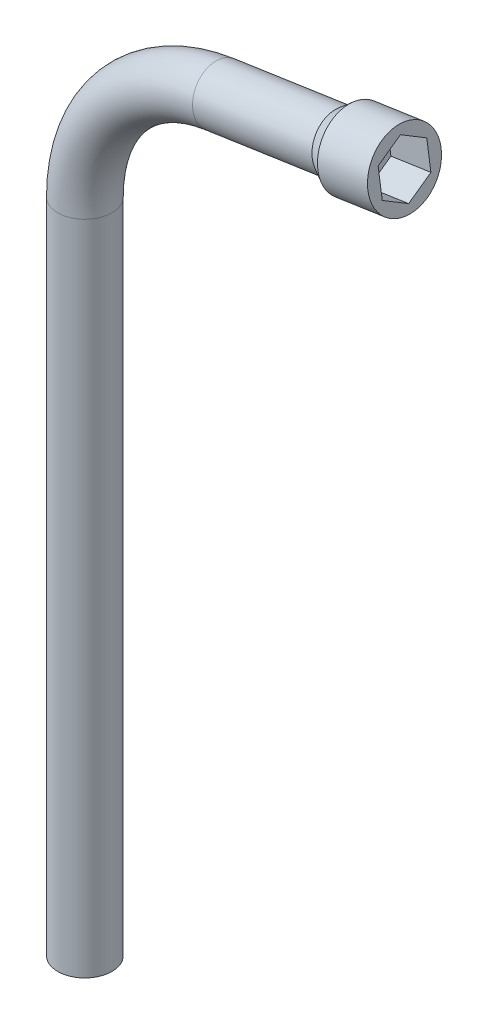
ISO-10303-21;
HEADER;
FILE_DESCRIPTION(('STEP AP214'),'2;1');
FILE_NAME('part.step','',(''),(''),'','','');
FILE_SCHEMA(('AUTOMOTIVE_DESIGN { 1 0 10303 214 1 1 1 1 }'));
ENDSEC;
DATA;
#1=APPLICATION_CONTEXT('core data for automotive mechanical design processes');
#2=APPLICATION_PROTOCOL_DEFINITION('international standard','automotive_design',2000,#1);
#3=PRODUCT_CONTEXT('',#1,'mechanical');
#4=PRODUCT('Part','Part','',(#3));
#5=PRODUCT_RELATED_PRODUCT_CATEGORY('part','',(#4));
#6=PRODUCT_DEFINITION_FORMATION('','',#4);
#7=PRODUCT_DEFINITION_CONTEXT('part definition',#1,'design');
#8=PRODUCT_DEFINITION('design','',#6,#7);
#9=PRODUCT_DEFINITION_SHAPE('','',#8);
#10=(LENGTH_UNIT() NAMED_UNIT(*) SI_UNIT(.MILLI.,.METRE.));
#11=(NAMED_UNIT(*) PLANE_ANGLE_UNIT() SI_UNIT($,.RADIAN.));
#12=(NAMED_UNIT(*) SI_UNIT($,.STERADIAN.) SOLID_ANGLE_UNIT());
#13=UNCERTAINTY_MEASURE_WITH_UNIT(LENGTH_MEASURE(1.E-05),#10,'distance_accuracy_value','');
#14=(GEOMETRIC_REPRESENTATION_CONTEXT(3) GLOBAL_UNCERTAINTY_ASSIGNED_CONTEXT((#13)) GLOBAL_UNIT_ASSIGNED_CONTEXT((#10,
#11,#12)) REPRESENTATION_CONTEXT('',''));
#15=CARTESIAN_POINT('',(0.,0.,0.));
#16=DIRECTION('',(0.,0.,1.));
#17=DIRECTION('',(1.,0.,0.));
#18=AXIS2_PLACEMENT_3D('',#15,#16,#17);
#19=CARTESIAN_POINT('',(0.,230.598043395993,0.));
#20=DIRECTION('',(0.,-1.,0.));
#21=DIRECTION('',(0.,0.,-1.));
#22=AXIS2_PLACEMENT_3D('',#19,#20,#21);
#23=CYLINDRICAL_SURFACE('',#22,9.52500000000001);
#24=CARTESIAN_POINT('',(0.,230.598043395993,0.));
#25=DIRECTION('',(0.,1.,0.));
#26=DIRECTION('',(-1.,0.,0.));
#27=AXIS2_PLACEMENT_3D('',#24,#25,#26);
#28=CIRCLE('',#27,9.52500000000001);
#29=CARTESIAN_POINT('',(-9.52500000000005,230.598043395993,0.));
#30=VERTEX_POINT('',#29);
#31=EDGE_CURVE('E36',#30,#30,#28,.T.);
#32=ORIENTED_EDGE('',*,*,#31,.F.);
#33=EDGE_LOOP('',(#32));
#34=FACE_BOUND('',#33,.T.);
#35=CARTESIAN_POINT('',(0.,0.,0.));
#36=DIRECTION('',(0.,1.,0.));
#37=DIRECTION('',(-1.,0.,0.));
#38=AXIS2_PLACEMENT_3D('',#35,#36,#37);
#39=CIRCLE('',#38,9.52500000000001);
#40=CARTESIAN_POINT('',(-9.52500000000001,0.,0.));
#41=VERTEX_POINT('',#40);
#42=EDGE_CURVE('E11',#41,#41,#39,.T.);
#43=ORIENTED_EDGE('',*,*,#42,.T.);
#44=EDGE_LOOP('',(#43));
#45=FACE_BOUND('',#44,.T.);
#46=ADVANCED_FACE('F29',(#34,#45),#23,.T.);
#47=CARTESIAN_POINT('',(55.5747064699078,230.598043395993,0.));
#48=DIRECTION('',(0.,0.,1.));
#49=DIRECTION('',(1.,0.,0.));
#50=AXIS2_PLACEMENT_3D('',#47,#48,#49);
#51=TOROIDAL_SURFACE('',#50,55.5747064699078,9.52500000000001);
#52=CARTESIAN_POINT('',(47.4030281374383,285.568687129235,0.));
#53=DIRECTION('',(0.989130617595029,0.147039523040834,0.));
#54=DIRECTION('',(-0.147039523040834,0.989130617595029,0.));
#55=AXIS2_PLACEMENT_3D('',#52,#53,#54);
#56=CIRCLE('',#55,9.52500000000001);
#57=CARTESIAN_POINT('',(46.0024766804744,294.990156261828,0.));
#58=VERTEX_POINT('',#57);
#59=EDGE_CURVE('E146',#58,#58,#56,.T.);
#60=CARTESIAN_POINT('',(55.5747064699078,230.598043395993,0.));
#61=DIRECTION('',(0.,0.,1.));
#62=DIRECTION('',(1.,0.,0.));
#63=AXIS2_PLACEMENT_3D('',#60,#61,#62);
#64=CIRCLE('',#63,65.0997064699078);
#65=EDGE_CURVE('',#58,#30,#64,.T.);
#66=ORIENTED_EDGE('',*,*,#59,.F.);
#67=ORIENTED_EDGE('',*,*,#31,.T.);
#68=ORIENTED_EDGE('',*,*,#65,.T.);
#69=ORIENTED_EDGE('',*,*,#65,.F.);
#70=EDGE_LOOP('',(#66,#68,#67,#69));
#71=FACE_BOUND('',#70,.T.);
#72=ADVANCED_FACE('F151',(#71),#51,.T.);
#73=CARTESIAN_POINT('',(47.4030281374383,285.568687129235,0.));
#74=DIRECTION('',(0.989130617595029,0.147039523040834,0.));
#75=DIRECTION('',(-0.147039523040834,0.989130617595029,0.));
#76=AXIS2_PLACEMENT_3D('',#73,#74,#75);
#77=CYLINDRICAL_SURFACE('',#76,9.52500000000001);
#78=ORIENTED_EDGE('',*,*,#59,.T.);
#79=EDGE_LOOP('',(#78));
#80=FACE_BOUND('',#79,.T.);
#81=CARTESIAN_POINT('',(89.3257626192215,291.800724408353,0.));
#82=DIRECTION('',(0.989130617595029,0.147039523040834,0.));
#83=DIRECTION('',(-0.147039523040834,0.989130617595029,0.));
#84=AXIS2_PLACEMENT_3D('',#81,#82,#83);
#85=CIRCLE('',#84,9.52500000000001);
#86=CARTESIAN_POINT('',(87.9252111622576,301.222193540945,0.));
#87=VERTEX_POINT('',#86);
#88=EDGE_CURVE('E143',#87,#87,#85,.T.);
#89=ORIENTED_EDGE('',*,*,#88,.F.);
#90=EDGE_LOOP('',(#89));
#91=FACE_BOUND('',#90,.T.);
#92=ADVANCED_FACE('F160',(#80,#91),#77,.T.);
#93=CARTESIAN_POINT('',(0.,0.,0.));
#94=DIRECTION('',(0.,1.,0.));
#95=DIRECTION('',(-1.,0.,0.));
#96=AXIS2_PLACEMENT_3D('',#93,#94,#95);
#97=PLANE('',#96);
#98=ORIENTED_EDGE('',*,*,#42,.F.);
#99=EDGE_LOOP('',(#98));
#100=FACE_BOUND('',#99,.T.);
#101=ADVANCED_FACE('F157',(#100),#97,.F.);
#102=CARTESIAN_POINT('',(94.6257154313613,292.58859056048,0.));
#103=DIRECTION('',(0.989130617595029,0.147039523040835,0.));
#104=DIRECTION('',(-0.147039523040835,0.989130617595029,0.));
#105=AXIS2_PLACEMENT_3D('',#102,#103,#104);
#106=CONICAL_SURFACE('',#105,12.8529219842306,0.555782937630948);
#107=ORIENTED_EDGE('',*,*,#88,.T.);
#108=EDGE_LOOP('',(#107));
#109=FACE_BOUND('',#108,.T.);
#110=CARTESIAN_POINT('',(94.6257154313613,292.58859056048,0.));
#111=DIRECTION('',(-0.989130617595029,-0.147039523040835,0.));
#112=DIRECTION('',(0.147039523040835,-0.989130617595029,0.));
#113=AXIS2_PLACEMENT_3D('',#110,#111,#112);
#114=CIRCLE('',#113,12.8529219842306);
#115=CARTESIAN_POINT('',(96.5156029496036,279.875371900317,0.));
#116=VERTEX_POINT('',#115);
#117=EDGE_CURVE('E140',#116,#116,#114,.T.);
#118=ORIENTED_EDGE('',*,*,#117,.T.);
#119=EDGE_LOOP('',(#118));
#120=FACE_BOUND('',#119,.T.);
#121=ADVANCED_FACE('F159',(#109,#120),#106,.T.);
#122=CARTESIAN_POINT('',(89.3257626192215,291.800724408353,0.));
#123=DIRECTION('',(-0.989130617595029,-0.147039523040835,0.));
#124=DIRECTION('',(0.147039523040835,-0.989130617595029,0.));
#125=AXIS2_PLACEMENT_3D('',#122,#123,#124);
#126=CYLINDRICAL_SURFACE('',#125,12.8529219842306);
#127=ORIENTED_EDGE('',*,*,#117,.F.);
#128=EDGE_LOOP('',(#127));
#129=FACE_BOUND('',#128,.T.);
#130=CARTESIAN_POINT('',(112.183151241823,295.19859670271,0.));
#131=DIRECTION('',(-0.989130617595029,-0.147039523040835,0.));
#132=DIRECTION('',(0.147039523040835,-0.989130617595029,0.));
#133=AXIS2_PLACEMENT_3D('',#130,#131,#132);
#134=CIRCLE('',#133,12.8529219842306);
#135=CARTESIAN_POINT('',(114.073038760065,282.485378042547,0.));
#136=VERTEX_POINT('',#135);
#137=EDGE_CURVE('E131',#136,#136,#134,.T.);
#138=ORIENTED_EDGE('',*,*,#137,.T.);
#139=EDGE_LOOP('',(#138));
#140=FACE_BOUND('',#139,.T.);
#141=ADVANCED_FACE('F166',(#129,#140),#126,.T.);
#142=CARTESIAN_POINT('',(110.293263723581,307.911815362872,0.));
#143=DIRECTION('',(-0.989130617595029,-0.147039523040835,0.));
#144=DIRECTION('',(0.147039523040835,-0.989130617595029,0.));
#145=AXIS2_PLACEMENT_3D('',#142,#143,#144);
#146=PLANE('',#145);
#147=DIRECTION('',(0.0735197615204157,-0.494565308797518,0.866025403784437));
#148=VECTOR('',#147,1.);
#149=CARTESIAN_POINT('',(110.733939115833,304.947404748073,0.));
#150=LINE('',#149,#148);
#151=CARTESIAN_POINT('',(110.733939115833,304.947404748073,0.));
#152=VERTEX_POINT('',#151);
#153=CARTESIAN_POINT('',(111.458545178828,300.073000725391,8.53549093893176));
#154=VERTEX_POINT('',#153);
#155=EDGE_CURVE('E97',#152,#154,#150,.T.);
#156=ORIENTED_EDGE('',*,*,#155,.F.);
#157=DIRECTION('',(-0.0735197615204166,0.494565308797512,0.86602540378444));
#158=VECTOR('',#157,1.);
#159=CARTESIAN_POINT('',(111.458545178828,300.073000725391,-8.5354909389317));
#160=LINE('',#159,#158);
#161=CARTESIAN_POINT('',(111.458545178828,300.073000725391,-8.5354909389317));
#162=VERTEX_POINT('',#161);
#163=EDGE_CURVE('E43',#162,#152,#160,.T.);
#164=ORIENTED_EDGE('',*,*,#163,.F.);
#165=DIRECTION('',(-0.147039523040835,0.989130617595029,0.));
#166=VECTOR('',#165,1.);
#167=CARTESIAN_POINT('',(112.907757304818,290.324192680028,-8.5354909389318));
#168=LINE('',#167,#166);
#169=CARTESIAN_POINT('',(112.907757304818,290.324192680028,-8.5354909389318));
#170=VERTEX_POINT('',#169);
#171=EDGE_CURVE('E113',#170,#162,#168,.T.);
#172=ORIENTED_EDGE('',*,*,#171,.F.);
#173=DIRECTION('',(-0.0735197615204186,0.494565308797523,-0.866025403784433));
#174=VECTOR('',#173,1.);
#175=CARTESIAN_POINT('',(113.632363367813,285.449788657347,0.));
#176=LINE('',#175,#174);
#177=CARTESIAN_POINT('',(113.632363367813,285.449788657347,0.));
#178=VERTEX_POINT('',#177);
#179=EDGE_CURVE('E107',#178,#170,#176,.T.);
#180=ORIENTED_EDGE('',*,*,#179,.F.);
#181=DIRECTION('',(0.0735197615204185,-0.494565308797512,-0.86602540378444));
#182=VECTOR('',#181,1.);
#183=CARTESIAN_POINT('',(112.907757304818,290.324192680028,8.53549093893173));
#184=LINE('',#183,#182);
#185=CARTESIAN_POINT('',(112.907757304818,290.324192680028,8.53549093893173));
#186=VERTEX_POINT('',#185);
#187=EDGE_CURVE('E105',#186,#178,#184,.T.);
#188=ORIENTED_EDGE('',*,*,#187,.F.);
#189=DIRECTION('',(0.147039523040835,-0.989130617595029,0.));
#190=VECTOR('',#189,1.);
#191=CARTESIAN_POINT('',(111.458545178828,300.073000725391,8.53549093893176));
#192=LINE('',#191,#190);
#193=EDGE_CURVE('E86',#154,#186,#192,.T.);
#194=ORIENTED_EDGE('',*,*,#193,.F.);
#195=EDGE_LOOP('',(#156,#164,#172,#180,#188,#194));
#196=FACE_BOUND('',#195,.T.);
#197=ORIENTED_EDGE('',*,*,#137,.F.);
#198=EDGE_LOOP('',(#197));
#199=FACE_BOUND('',#198,.T.);
#200=ADVANCED_FACE('F101',(#196,#199),#146,.F.);
#201=CARTESIAN_POINT('',(97.4258871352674,297.986971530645,-8.5354909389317));
#202=DIRECTION('',(-0.127339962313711,0.856612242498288,-0.499999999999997));
#203=DIRECTION('',(0.,0.50410384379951,0.863643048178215));
#204=AXIS2_PLACEMENT_3D('',#201,#202,#203);
#205=PLANE('',#204);
#206=ORIENTED_EDGE('',*,*,#163,.T.);
#207=DIRECTION('',(0.989130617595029,0.147039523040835,0.));
#208=VECTOR('',#207,1.);
#209=CARTESIAN_POINT('',(96.7012810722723,302.861375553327,0.));
#210=LINE('',#209,#208);
#211=CARTESIAN_POINT('',(96.7012810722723,302.861375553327,0.));
#212=VERTEX_POINT('',#211);
#213=EDGE_CURVE('E94',#212,#152,#210,.T.);
#214=ORIENTED_EDGE('',*,*,#213,.F.);
#215=DIRECTION('',(-0.0735197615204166,0.494565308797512,0.86602540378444));
#216=VECTOR('',#215,1.);
#217=CARTESIAN_POINT('',(97.4258871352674,297.986971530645,-8.5354909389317));
#218=LINE('',#217,#216);
#219=CARTESIAN_POINT('',(97.4258871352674,297.986971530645,-8.5354909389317));
#220=VERTEX_POINT('',#219);
#221=EDGE_CURVE('E115',#220,#212,#218,.T.);
#222=ORIENTED_EDGE('',*,*,#221,.F.);
#223=DIRECTION('',(0.989130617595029,0.147039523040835,0.));
#224=VECTOR('',#223,1.);
#225=CARTESIAN_POINT('',(97.4258871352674,297.986971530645,-8.5354909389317));
#226=LINE('',#225,#224);
#227=EDGE_CURVE('E50',#220,#162,#226,.T.);
#228=ORIENTED_EDGE('',*,*,#227,.T.);
#229=EDGE_LOOP('',(#206,#214,#222,#228));
#230=FACE_BOUND('',#229,.T.);
#231=ADVANCED_FACE('F186',(#230),#205,.F.);
#232=CARTESIAN_POINT('',(98.8750992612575,288.238163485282,-8.5354909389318));
#233=DIRECTION('',(0.,0.,-1.));
#234=DIRECTION('',(0.,1.,0.));
#235=AXIS2_PLACEMENT_3D('',#232,#233,#234);
#236=PLANE('',#235);
#237=ORIENTED_EDGE('',*,*,#171,.T.);
#238=ORIENTED_EDGE('',*,*,#227,.F.);
#239=DIRECTION('',(-0.147039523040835,0.989130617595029,0.));
#240=VECTOR('',#239,1.);
#241=CARTESIAN_POINT('',(98.8750992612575,288.238163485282,-8.5354909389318));
#242=LINE('',#241,#240);
#243=CARTESIAN_POINT('',(98.8750992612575,288.238163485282,-8.5354909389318));
#244=VERTEX_POINT('',#243);
#245=EDGE_CURVE('E127',#244,#220,#242,.T.);
#246=ORIENTED_EDGE('',*,*,#245,.F.);
#247=DIRECTION('',(0.989130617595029,0.147039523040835,0.));
#248=VECTOR('',#247,1.);
#249=CARTESIAN_POINT('',(98.8750992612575,288.238163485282,-8.5354909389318));
#250=LINE('',#249,#248);
#251=EDGE_CURVE('E132',#244,#170,#250,.T.);
#252=ORIENTED_EDGE('',*,*,#251,.T.);
#253=EDGE_LOOP('',(#237,#238,#246,#252));
#254=FACE_BOUND('',#253,.T.);
#255=ADVANCED_FACE('F191',(#254),#236,.F.);
#256=CARTESIAN_POINT('',(99.5997053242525,283.363759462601,0.));
#257=DIRECTION('',(0.12733996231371,-0.856612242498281,-0.500000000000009));
#258=DIRECTION('',(0.,0.504103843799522,-0.863643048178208));
#259=AXIS2_PLACEMENT_3D('',#256,#257,#258);
#260=PLANE('',#259);
#261=ORIENTED_EDGE('',*,*,#179,.T.);
#262=ORIENTED_EDGE('',*,*,#251,.F.);
#263=DIRECTION('',(-0.0735197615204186,0.494565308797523,-0.866025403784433));
#264=VECTOR('',#263,1.);
#265=CARTESIAN_POINT('',(99.5997053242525,283.363759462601,0.));
#266=LINE('',#265,#264);
#267=CARTESIAN_POINT('',(99.5997053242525,283.363759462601,0.));
#268=VERTEX_POINT('',#267);
#269=EDGE_CURVE('E124',#268,#244,#266,.T.);
#270=ORIENTED_EDGE('',*,*,#269,.F.);
#271=DIRECTION('',(0.989130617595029,0.147039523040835,0.));
#272=VECTOR('',#271,1.);
#273=CARTESIAN_POINT('',(99.5997053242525,283.363759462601,0.));
#274=LINE('',#273,#272);
#275=EDGE_CURVE('E134',#268,#178,#274,.T.);
#276=ORIENTED_EDGE('',*,*,#275,.T.);
#277=EDGE_LOOP('',(#261,#262,#270,#276));
#278=FACE_BOUND('',#277,.T.);
#279=ADVANCED_FACE('F202',(#278),#260,.F.);
#280=CARTESIAN_POINT('',(98.8750992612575,288.238163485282,8.53549093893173));
#281=DIRECTION('',(0.127339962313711,-0.856612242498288,0.499999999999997));
#282=DIRECTION('',(0.,-0.50410384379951,-0.863643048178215));
#283=AXIS2_PLACEMENT_3D('',#280,#281,#282);
#284=PLANE('',#283);
#285=ORIENTED_EDGE('',*,*,#187,.T.);
#286=ORIENTED_EDGE('',*,*,#275,.F.);
#287=DIRECTION('',(0.0735197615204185,-0.494565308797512,-0.86602540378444));
#288=VECTOR('',#287,1.);
#289=CARTESIAN_POINT('',(98.8750992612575,288.238163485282,8.53549093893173));
#290=LINE('',#289,#288);
#291=CARTESIAN_POINT('',(98.8750992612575,288.238163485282,8.53549093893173));
#292=VERTEX_POINT('',#291);
#293=EDGE_CURVE('E121',#292,#268,#290,.T.);
#294=ORIENTED_EDGE('',*,*,#293,.F.);
#295=DIRECTION('',(0.989130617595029,0.147039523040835,0.));
#296=VECTOR('',#295,1.);
#297=CARTESIAN_POINT('',(98.8750992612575,288.238163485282,8.53549093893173));
#298=LINE('',#297,#296);
#299=EDGE_CURVE('E93',#292,#186,#298,.T.);
#300=ORIENTED_EDGE('',*,*,#299,.T.);
#301=EDGE_LOOP('',(#285,#286,#294,#300));
#302=FACE_BOUND('',#301,.T.);
#303=ADVANCED_FACE('F199',(#302),#284,.F.);
#304=CARTESIAN_POINT('',(97.4258871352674,297.986971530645,8.53549093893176));
#305=DIRECTION('',(0.,0.,1.));
#306=DIRECTION('',(0.,-1.,0.));
#307=AXIS2_PLACEMENT_3D('',#304,#305,#306);
#308=PLANE('',#307);
#309=ORIENTED_EDGE('',*,*,#193,.T.);
#310=ORIENTED_EDGE('',*,*,#299,.F.);
#311=DIRECTION('',(0.147039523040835,-0.989130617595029,0.));
#312=VECTOR('',#311,1.);
#313=CARTESIAN_POINT('',(97.4258871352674,297.986971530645,8.53549093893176));
#314=LINE('',#313,#312);
#315=CARTESIAN_POINT('',(97.4258871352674,297.986971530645,8.53549093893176));
#316=VERTEX_POINT('',#315);
#317=EDGE_CURVE('E89',#316,#292,#314,.T.);
#318=ORIENTED_EDGE('',*,*,#317,.F.);
#319=DIRECTION('',(0.989130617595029,0.147039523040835,0.));
#320=VECTOR('',#319,1.);
#321=CARTESIAN_POINT('',(97.4258871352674,297.986971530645,8.53549093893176));
#322=LINE('',#321,#320);
#323=EDGE_CURVE('E82',#316,#154,#322,.T.);
#324=ORIENTED_EDGE('',*,*,#323,.T.);
#325=EDGE_LOOP('',(#309,#310,#318,#324));
#326=FACE_BOUND('',#325,.T.);
#327=ADVANCED_FACE('F84',(#326),#308,.F.);
#328=CARTESIAN_POINT('',(96.7012810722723,302.861375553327,0.));
#329=DIRECTION('',(-0.12733996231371,0.856612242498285,0.500000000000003));
#330=DIRECTION('',(0.,-0.504103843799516,0.863643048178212));
#331=AXIS2_PLACEMENT_3D('',#328,#329,#330);
#332=PLANE('',#331);
#333=ORIENTED_EDGE('',*,*,#155,.T.);
#334=ORIENTED_EDGE('',*,*,#323,.F.);
#335=DIRECTION('',(0.0735197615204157,-0.494565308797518,0.866025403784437));
#336=VECTOR('',#335,1.);
#337=CARTESIAN_POINT('',(96.7012810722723,302.861375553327,0.));
#338=LINE('',#337,#336);
#339=EDGE_CURVE('E118',#212,#316,#338,.T.);
#340=ORIENTED_EDGE('',*,*,#339,.F.);
#341=ORIENTED_EDGE('',*,*,#213,.T.);
#342=EDGE_LOOP('',(#333,#334,#340,#341));
#343=FACE_BOUND('',#342,.T.);
#344=ADVANCED_FACE('F98',(#343),#332,.F.);
#345=CARTESIAN_POINT('',(98.1504931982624,293.112567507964,-17.0709818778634));
#346=DIRECTION('',(-0.989130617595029,-0.147039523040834,0.));
#347=DIRECTION('',(0.147039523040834,-0.989130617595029,0.));
#348=AXIS2_PLACEMENT_3D('',#345,#346,#347);
#349=PLANE('',#348);
#350=ORIENTED_EDGE('',*,*,#221,.T.);
#351=ORIENTED_EDGE('',*,*,#339,.T.);
#352=ORIENTED_EDGE('',*,*,#317,.T.);
#353=ORIENTED_EDGE('',*,*,#293,.T.);
#354=ORIENTED_EDGE('',*,*,#269,.T.);
#355=ORIENTED_EDGE('',*,*,#245,.T.);
#356=EDGE_LOOP('',(#350,#351,#352,#353,#354,#355));
#357=FACE_BOUND('',#356,.T.);
#358=ADVANCED_FACE('F196',(#357),#349,.F.);
#359=CLOSED_SHELL('',(#46,#72,#92,#101,#121,#141,#200,#231,#255,#279,#303,#327,#344,#358));
#360=MANIFOLD_SOLID_BREP('B2',#359);
#361=ADVANCED_BREP_SHAPE_REPRESENTATION('',(#18,#360),#14);
#362=SHAPE_DEFINITION_REPRESENTATION(#9,#361);
ENDSEC;
END-ISO-10303-21;
